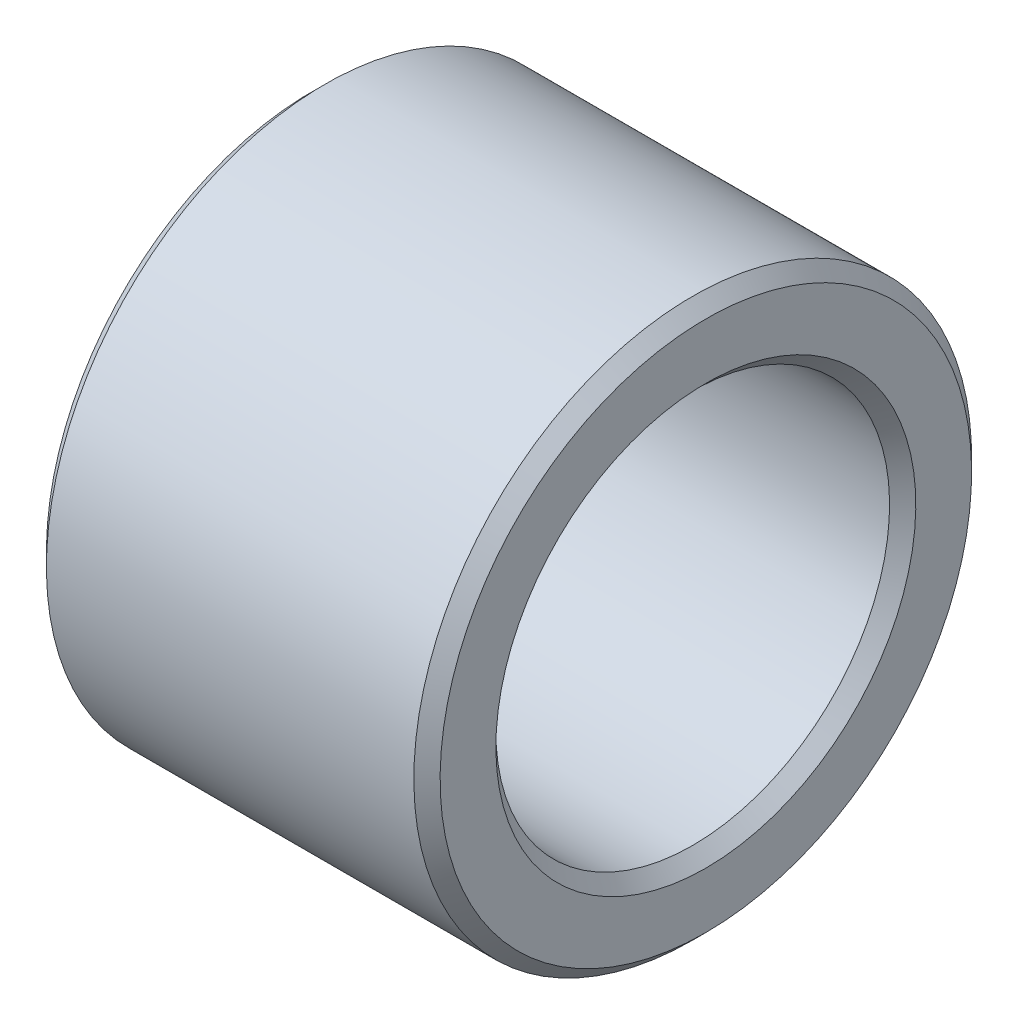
ISO-10303-21;
HEADER;
FILE_DESCRIPTION(('STEP AP214'),'2;1');
FILE_NAME('part.step','',(''),(''),'','','');
FILE_SCHEMA(('AUTOMOTIVE_DESIGN { 1 0 10303 214 1 1 1 1 }'));
ENDSEC;
DATA;
#1=APPLICATION_CONTEXT('core data for automotive mechanical design processes');
#2=APPLICATION_PROTOCOL_DEFINITION('international standard','automotive_design',2000,#1);
#3=PRODUCT_CONTEXT('',#1,'mechanical');
#4=PRODUCT('Part','Part','',(#3));
#5=PRODUCT_RELATED_PRODUCT_CATEGORY('part','',(#4));
#6=PRODUCT_DEFINITION_FORMATION('','',#4);
#7=PRODUCT_DEFINITION_CONTEXT('part definition',#1,'design');
#8=PRODUCT_DEFINITION('design','',#6,#7);
#9=PRODUCT_DEFINITION_SHAPE('','',#8);
#10=(LENGTH_UNIT() NAMED_UNIT(*) SI_UNIT(.MILLI.,.METRE.));
#11=(NAMED_UNIT(*) PLANE_ANGLE_UNIT() SI_UNIT($,.RADIAN.));
#12=(NAMED_UNIT(*) SI_UNIT($,.STERADIAN.) SOLID_ANGLE_UNIT());
#13=UNCERTAINTY_MEASURE_WITH_UNIT(LENGTH_MEASURE(1.E-05),#10,'distance_accuracy_value','');
#14=(GEOMETRIC_REPRESENTATION_CONTEXT(3) GLOBAL_UNCERTAINTY_ASSIGNED_CONTEXT((#13)) GLOBAL_UNIT_ASSIGNED_CONTEXT((#10,
#11,#12)) REPRESENTATION_CONTEXT('',''));
#15=CARTESIAN_POINT('',(0.,0.,0.));
#16=DIRECTION('',(0.,0.,1.));
#17=DIRECTION('',(1.,0.,0.));
#18=AXIS2_PLACEMENT_3D('',#15,#16,#17);
#19=CARTESIAN_POINT('',(0.,-7.25,0.));
#20=DIRECTION('',(-1.,0.,0.));
#21=DIRECTION('',(0.,1.,0.));
#22=AXIS2_PLACEMENT_3D('',#19,#20,#21);
#23=PLANE('',#22);
#24=CARTESIAN_POINT('',(0.,0.,0.));
#25=DIRECTION('',(1.,0.,0.));
#26=DIRECTION('',(0.,-1.,0.));
#27=AXIS2_PLACEMENT_3D('',#24,#25,#26);
#28=CIRCLE('',#27,6.4);
#29=CARTESIAN_POINT('',(0.,-6.4,0.));
#30=VERTEX_POINT('',#29);
#31=EDGE_CURVE('E9',#30,#30,#28,.T.);
#32=ORIENTED_EDGE('',*,*,#31,.T.);
#33=EDGE_LOOP('',(#32));
#34=FACE_BOUND('',#33,.T.);
#35=CARTESIAN_POINT('',(0.,0.,0.));
#36=DIRECTION('',(1.,0.,0.));
#37=DIRECTION('',(0.,-1.,0.));
#38=AXIS2_PLACEMENT_3D('',#35,#36,#37);
#39=CIRCLE('',#38,8.1);
#40=CARTESIAN_POINT('',(0.,-8.1,0.));
#41=VERTEX_POINT('',#40);
#42=EDGE_CURVE('E53',#41,#41,#39,.T.);
#43=ORIENTED_EDGE('',*,*,#42,.F.);
#44=EDGE_LOOP('',(#43));
#45=FACE_BOUND('',#44,.T.);
#46=ADVANCED_FACE('F15',(#34,#45),#23,.T.);
#47=CARTESIAN_POINT('',(0.2,0.,0.));
#48=DIRECTION('',(-1.,0.,0.));
#49=DIRECTION('',(0.,-1.,0.));
#50=AXIS2_PLACEMENT_3D('',#47,#48,#49);
#51=CONICAL_SURFACE('',#50,6.2,0.785398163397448);
#52=CARTESIAN_POINT('',(0.4,0.,0.));
#53=DIRECTION('',(1.,0.,0.));
#54=DIRECTION('',(0.,-1.,0.));
#55=AXIS2_PLACEMENT_3D('',#52,#53,#54);
#56=CIRCLE('',#55,6.);
#57=CARTESIAN_POINT('',(0.4,-6.,0.));
#58=VERTEX_POINT('',#57);
#59=EDGE_CURVE('E22',#58,#58,#56,.T.);
#60=ORIENTED_EDGE('',*,*,#59,.T.);
#61=EDGE_LOOP('',(#60));
#62=FACE_BOUND('',#61,.T.);
#63=ORIENTED_EDGE('',*,*,#31,.F.);
#64=EDGE_LOOP('',(#63));
#65=FACE_BOUND('',#64,.T.);
#66=ADVANCED_FACE('F82',(#62,#65),#51,.F.);
#67=CARTESIAN_POINT('',(6.,0.,0.));
#68=DIRECTION('',(-1.,0.,0.));
#69=DIRECTION('',(0.,-1.,0.));
#70=AXIS2_PLACEMENT_3D('',#67,#68,#69);
#71=CYLINDRICAL_SURFACE('',#70,6.);
#72=CARTESIAN_POINT('',(11.6,0.,0.));
#73=DIRECTION('',(1.,0.,0.));
#74=DIRECTION('',(0.,-1.,0.));
#75=AXIS2_PLACEMENT_3D('',#72,#73,#74);
#76=CIRCLE('',#75,6.);
#77=CARTESIAN_POINT('',(11.6,-6.,0.));
#78=VERTEX_POINT('',#77);
#79=EDGE_CURVE('E58',#78,#78,#76,.T.);
#80=ORIENTED_EDGE('',*,*,#79,.T.);
#81=EDGE_LOOP('',(#80));
#82=FACE_BOUND('',#81,.T.);
#83=ORIENTED_EDGE('',*,*,#59,.F.);
#84=EDGE_LOOP('',(#83));
#85=FACE_BOUND('',#84,.T.);
#86=ADVANCED_FACE('F66',(#82,#85),#71,.F.);
#87=CARTESIAN_POINT('',(11.8,0.,0.));
#88=DIRECTION('',(1.,0.,0.));
#89=DIRECTION('',(0.,-1.,0.));
#90=AXIS2_PLACEMENT_3D('',#87,#88,#89);
#91=CONICAL_SURFACE('',#90,6.2,0.785398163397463);
#92=CARTESIAN_POINT('',(12.,0.,0.));
#93=DIRECTION('',(1.,0.,0.));
#94=DIRECTION('',(0.,-1.,0.));
#95=AXIS2_PLACEMENT_3D('',#92,#93,#94);
#96=CIRCLE('',#95,6.4);
#97=CARTESIAN_POINT('',(12.,-6.4,0.));
#98=VERTEX_POINT('',#97);
#99=EDGE_CURVE('E63',#98,#98,#96,.T.);
#100=ORIENTED_EDGE('',*,*,#99,.T.);
#101=EDGE_LOOP('',(#100));
#102=FACE_BOUND('',#101,.T.);
#103=ORIENTED_EDGE('',*,*,#79,.F.);
#104=EDGE_LOOP('',(#103));
#105=FACE_BOUND('',#104,.T.);
#106=ADVANCED_FACE('F69',(#102,#105),#91,.F.);
#107=CARTESIAN_POINT('',(12.,-7.25,0.));
#108=DIRECTION('',(1.,0.,0.));
#109=DIRECTION('',(0.,-1.,0.));
#110=AXIS2_PLACEMENT_3D('',#107,#108,#109);
#111=PLANE('',#110);
#112=CARTESIAN_POINT('',(12.,0.,0.));
#113=DIRECTION('',(1.,0.,0.));
#114=DIRECTION('',(0.,-1.,0.));
#115=AXIS2_PLACEMENT_3D('',#112,#113,#114);
#116=CIRCLE('',#115,8.1);
#117=CARTESIAN_POINT('',(12.,-8.1,0.));
#118=VERTEX_POINT('',#117);
#119=EDGE_CURVE('E61',#118,#118,#116,.T.);
#120=ORIENTED_EDGE('',*,*,#119,.T.);
#121=EDGE_LOOP('',(#120));
#122=FACE_BOUND('',#121,.T.);
#123=ORIENTED_EDGE('',*,*,#99,.F.);
#124=EDGE_LOOP('',(#123));
#125=FACE_BOUND('',#124,.T.);
#126=ADVANCED_FACE('F71',(#122,#125),#111,.T.);
#127=CARTESIAN_POINT('',(11.8,0.,0.));
#128=DIRECTION('',(-1.,0.,0.));
#129=DIRECTION('',(0.,-1.,0.));
#130=AXIS2_PLACEMENT_3D('',#127,#128,#129);
#131=CONICAL_SURFACE('',#130,8.3,0.785398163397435);
#132=CARTESIAN_POINT('',(11.6,0.,0.));
#133=DIRECTION('',(1.,0.,0.));
#134=DIRECTION('',(0.,-1.,0.));
#135=AXIS2_PLACEMENT_3D('',#132,#133,#134);
#136=CIRCLE('',#135,8.5);
#137=CARTESIAN_POINT('',(11.6,-8.5,0.));
#138=VERTEX_POINT('',#137);
#139=EDGE_CURVE('E55',#138,#138,#136,.T.);
#140=ORIENTED_EDGE('',*,*,#139,.T.);
#141=EDGE_LOOP('',(#140));
#142=FACE_BOUND('',#141,.T.);
#143=ORIENTED_EDGE('',*,*,#119,.F.);
#144=EDGE_LOOP('',(#143));
#145=FACE_BOUND('',#144,.T.);
#146=ADVANCED_FACE('F79',(#142,#145),#131,.T.);
#147=CARTESIAN_POINT('',(6.,0.,0.));
#148=DIRECTION('',(-1.,0.,0.));
#149=DIRECTION('',(0.,-1.,0.));
#150=AXIS2_PLACEMENT_3D('',#147,#148,#149);
#151=CYLINDRICAL_SURFACE('',#150,8.5);
#152=CARTESIAN_POINT('',(0.4,0.,0.));
#153=DIRECTION('',(1.,0.,0.));
#154=DIRECTION('',(0.,-1.,0.));
#155=AXIS2_PLACEMENT_3D('',#152,#153,#154);
#156=CIRCLE('',#155,8.5);
#157=CARTESIAN_POINT('',(0.4,-8.5,0.));
#158=VERTEX_POINT('',#157);
#159=EDGE_CURVE('E49',#158,#158,#156,.T.);
#160=ORIENTED_EDGE('',*,*,#159,.T.);
#161=EDGE_LOOP('',(#160));
#162=FACE_BOUND('',#161,.T.);
#163=ORIENTED_EDGE('',*,*,#139,.F.);
#164=EDGE_LOOP('',(#163));
#165=FACE_BOUND('',#164,.T.);
#166=ADVANCED_FACE('F50',(#162,#165),#151,.T.);
#167=CARTESIAN_POINT('',(0.2,0.,0.));
#168=DIRECTION('',(1.,0.,0.));
#169=DIRECTION('',(0.,-1.,0.));
#170=AXIS2_PLACEMENT_3D('',#167,#168,#169);
#171=CONICAL_SURFACE('',#170,8.3,0.785398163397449);
#172=ORIENTED_EDGE('',*,*,#42,.T.);
#173=EDGE_LOOP('',(#172));
#174=FACE_BOUND('',#173,.T.);
#175=ORIENTED_EDGE('',*,*,#159,.F.);
#176=EDGE_LOOP('',(#175));
#177=FACE_BOUND('',#176,.T.);
#178=ADVANCED_FACE('F92',(#174,#177),#171,.T.);
#179=CLOSED_SHELL('',(#46,#66,#86,#106,#126,#146,#166,#178));
#180=MANIFOLD_SOLID_BREP('B1',#179);
#181=ADVANCED_BREP_SHAPE_REPRESENTATION('',(#18,#180),#14);
#182=SHAPE_DEFINITION_REPRESENTATION(#9,#181);
ENDSEC;
END-ISO-10303-21;
